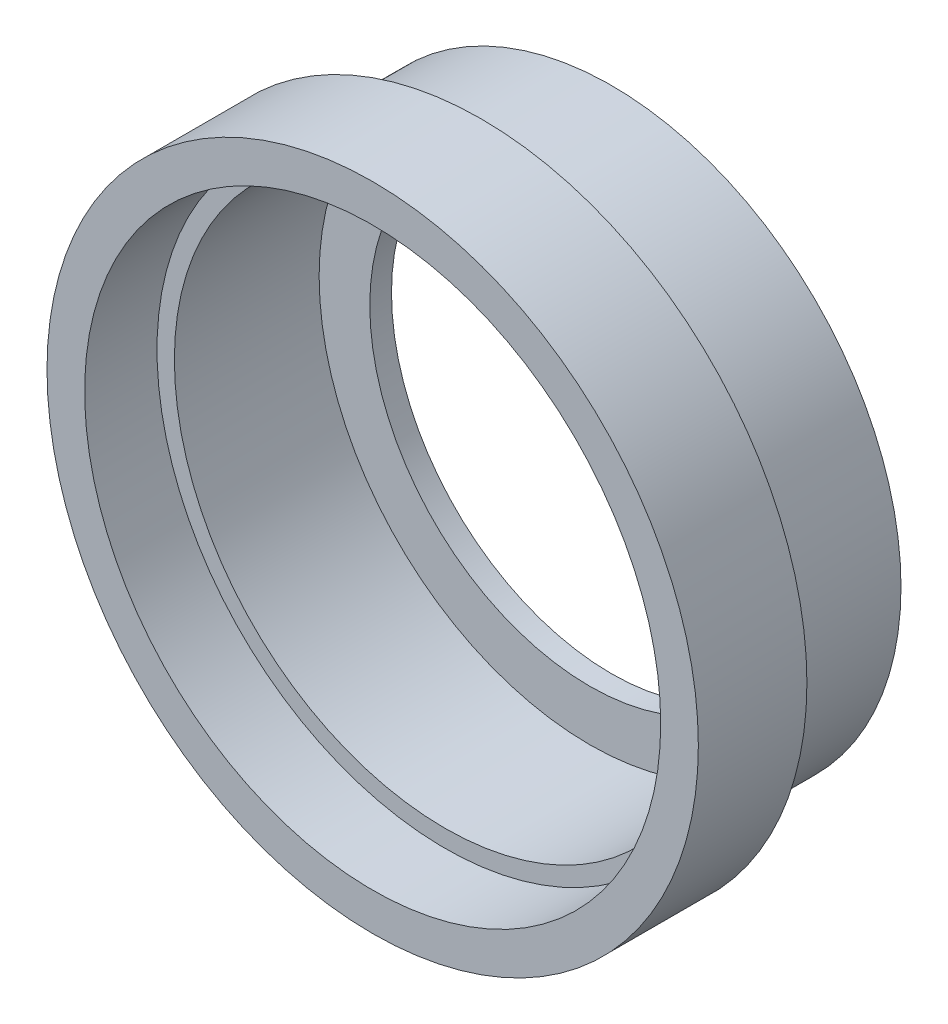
ISO-10303-21;
HEADER;
FILE_DESCRIPTION(('STEP AP214'),'2;1');
FILE_NAME('part.step','',(''),(''),'','','');
FILE_SCHEMA(('AUTOMOTIVE_DESIGN { 1 0 10303 214 1 1 1 1 }'));
ENDSEC;
DATA;
#1=APPLICATION_CONTEXT('core data for automotive mechanical design processes');
#2=APPLICATION_PROTOCOL_DEFINITION('international standard','automotive_design',2000,#1);
#3=PRODUCT_CONTEXT('',#1,'mechanical');
#4=PRODUCT('Part','Part','',(#3));
#5=PRODUCT_RELATED_PRODUCT_CATEGORY('part','',(#4));
#6=PRODUCT_DEFINITION_FORMATION('','',#4);
#7=PRODUCT_DEFINITION_CONTEXT('part definition',#1,'design');
#8=PRODUCT_DEFINITION('design','',#6,#7);
#9=PRODUCT_DEFINITION_SHAPE('','',#8);
#10=(LENGTH_UNIT() NAMED_UNIT(*) SI_UNIT(.MILLI.,.METRE.));
#11=(NAMED_UNIT(*) PLANE_ANGLE_UNIT() SI_UNIT($,.RADIAN.));
#12=(NAMED_UNIT(*) SI_UNIT($,.STERADIAN.) SOLID_ANGLE_UNIT());
#13=UNCERTAINTY_MEASURE_WITH_UNIT(LENGTH_MEASURE(1.E-05),#10,'distance_accuracy_value','');
#14=(GEOMETRIC_REPRESENTATION_CONTEXT(3) GLOBAL_UNCERTAINTY_ASSIGNED_CONTEXT((#13)) GLOBAL_UNIT_ASSIGNED_CONTEXT((#10,
#11,#12)) REPRESENTATION_CONTEXT('',''));
#15=CARTESIAN_POINT('',(0.,0.,0.));
#16=DIRECTION('',(0.,0.,1.));
#17=DIRECTION('',(1.,0.,0.));
#18=AXIS2_PLACEMENT_3D('',#15,#16,#17);
#19=CARTESIAN_POINT('',(0.,0.,20.955));
#20=DIRECTION('',(0.,0.,-1.));
#21=DIRECTION('',(-1.,0.,0.));
#22=AXIS2_PLACEMENT_3D('',#19,#20,#21);
#23=CYLINDRICAL_SURFACE('',#22,19.304);
#24=CARTESIAN_POINT('',(0.,0.,0.));
#25=DIRECTION('',(0.,0.,-1.));
#26=DIRECTION('',(-1.,0.,0.));
#27=AXIS2_PLACEMENT_3D('',#24,#25,#26);
#28=CIRCLE('',#27,19.304);
#29=CARTESIAN_POINT('',(-19.304,0.,0.));
#30=VERTEX_POINT('',#29);
#31=EDGE_CURVE('E48',#30,#30,#28,.T.);
#32=ORIENTED_EDGE('',*,*,#31,.T.);
#33=EDGE_LOOP('',(#32));
#34=FACE_BOUND('',#33,.T.);
#35=CARTESIAN_POINT('',(0.,0.,1.905));
#36=DIRECTION('',(0.,0.,1.));
#37=DIRECTION('',(1.,0.,0.));
#38=AXIS2_PLACEMENT_3D('',#35,#36,#37);
#39=CIRCLE('',#38,19.304);
#40=CARTESIAN_POINT('',(19.304,0.,1.905));
#41=VERTEX_POINT('',#40);
#42=EDGE_CURVE('E32',#41,#41,#39,.F.);
#43=ORIENTED_EDGE('',*,*,#42,.F.);
#44=EDGE_LOOP('',(#43));
#45=FACE_BOUND('',#44,.T.);
#46=ADVANCED_FACE('F28',(#34,#45),#23,.F.);
#47=CARTESIAN_POINT('',(0.,0.,11.43));
#48=DIRECTION('',(0.,0.,-1.));
#49=DIRECTION('',(-1.,0.,0.));
#50=AXIS2_PLACEMENT_3D('',#47,#48,#49);
#51=CYLINDRICAL_SURFACE('',#50,25.4);
#52=CARTESIAN_POINT('',(0.,0.,11.43));
#53=DIRECTION('',(0.,0.,1.));
#54=DIRECTION('',(1.,0.,0.));
#55=AXIS2_PLACEMENT_3D('',#52,#53,#54);
#56=CIRCLE('',#55,25.4);
#57=CARTESIAN_POINT('',(25.4,0.,11.43));
#58=VERTEX_POINT('',#57);
#59=EDGE_CURVE('E10',#58,#58,#56,.T.);
#60=ORIENTED_EDGE('',*,*,#59,.F.);
#61=EDGE_LOOP('',(#60));
#62=FACE_BOUND('',#61,.T.);
#63=CARTESIAN_POINT('',(0.,0.,0.));
#64=DIRECTION('',(0.,0.,1.));
#65=DIRECTION('',(1.,0.,0.));
#66=AXIS2_PLACEMENT_3D('',#63,#64,#65);
#67=CIRCLE('',#66,25.4);
#68=CARTESIAN_POINT('',(25.4,0.,0.));
#69=VERTEX_POINT('',#68);
#70=EDGE_CURVE('E36',#69,#69,#67,.T.);
#71=ORIENTED_EDGE('',*,*,#70,.T.);
#72=EDGE_LOOP('',(#71));
#73=FACE_BOUND('',#72,.T.);
#74=ADVANCED_FACE('F30',(#62,#73),#51,.T.);
#75=CARTESIAN_POINT('',(0.,0.,0.));
#76=DIRECTION('',(0.,0.,1.));
#77=DIRECTION('',(1.,0.,0.));
#78=AXIS2_PLACEMENT_3D('',#75,#76,#77);
#79=PLANE('',#78);
#80=ORIENTED_EDGE('',*,*,#31,.F.);
#81=EDGE_LOOP('',(#80));
#82=FACE_BOUND('',#81,.T.);
#83=ORIENTED_EDGE('',*,*,#70,.F.);
#84=EDGE_LOOP('',(#83));
#85=FACE_BOUND('',#84,.T.);
#86=ADVANCED_FACE('F93',(#82,#85),#79,.F.);
#87=CARTESIAN_POINT('',(0.,0.,11.43));
#88=DIRECTION('',(0.,0.,1.));
#89=DIRECTION('',(1.,0.,0.));
#90=AXIS2_PLACEMENT_3D('',#87,#88,#89);
#91=PLANE('',#90);
#92=CARTESIAN_POINT('',(0.,0.,11.43));
#93=DIRECTION('',(0.,0.,1.));
#94=DIRECTION('',(1.,0.,0.));
#95=AXIS2_PLACEMENT_3D('',#92,#93,#94);
#96=CIRCLE('',#95,28.575);
#97=CARTESIAN_POINT('',(-28.575,0.,11.43));
#98=VERTEX_POINT('',#97);
#99=EDGE_CURVE('E45',#98,#98,#96,.T.);
#100=ORIENTED_EDGE('',*,*,#99,.F.);
#101=EDGE_LOOP('',(#100));
#102=FACE_BOUND('',#101,.T.);
#103=ORIENTED_EDGE('',*,*,#59,.T.);
#104=EDGE_LOOP('',(#103));
#105=FACE_BOUND('',#104,.T.);
#106=ADVANCED_FACE('F88',(#102,#105),#91,.F.);
#107=CARTESIAN_POINT('',(0.,0.,20.955));
#108=DIRECTION('',(0.,0.,-1.));
#109=DIRECTION('',(-1.,0.,0.));
#110=AXIS2_PLACEMENT_3D('',#107,#108,#109);
#111=CYLINDRICAL_SURFACE('',#110,28.575);
#112=CARTESIAN_POINT('',(0.,0.,20.955));
#113=DIRECTION('',(0.,0.,1.));
#114=DIRECTION('',(1.,0.,0.));
#115=AXIS2_PLACEMENT_3D('',#112,#113,#114);
#116=CIRCLE('',#115,28.575);
#117=CARTESIAN_POINT('',(-28.575,0.,20.955));
#118=VERTEX_POINT('',#117);
#119=EDGE_CURVE('E40',#118,#118,#116,.T.);
#120=CARTESIAN_POINT('',(-28.575,0.,20.955));
#121=CARTESIAN_POINT('',(-28.575,0.,20.85578125));
#122=CARTESIAN_POINT('',(-28.575,0.,20.7565625));
#123=CARTESIAN_POINT('',(-28.575,0.,20.558125));
#124=CARTESIAN_POINT('',(-28.575,0.,20.45890625));
#125=CARTESIAN_POINT('',(-28.575,0.,20.26046875));
#126=CARTESIAN_POINT('',(-28.575,0.,20.16125));
#127=CARTESIAN_POINT('',(-28.575,0.,19.9628125));
#128=CARTESIAN_POINT('',(-28.575,0.,19.86359375));
#129=CARTESIAN_POINT('',(-28.575,0.,19.66515625));
#130=CARTESIAN_POINT('',(-28.575,0.,19.5659375));
#131=CARTESIAN_POINT('',(-28.575,0.,19.3675));
#132=CARTESIAN_POINT('',(-28.575,0.,19.26828125));
#133=CARTESIAN_POINT('',(-28.575,0.,19.06984375));
#134=CARTESIAN_POINT('',(-28.575,0.,18.970625));
#135=CARTESIAN_POINT('',(-28.575,0.,18.7721875));
#136=CARTESIAN_POINT('',(-28.575,0.,18.67296875));
#137=CARTESIAN_POINT('',(-28.575,0.,18.47453125));
#138=CARTESIAN_POINT('',(-28.575,0.,18.3753125));
#139=CARTESIAN_POINT('',(-28.575,0.,18.176875));
#140=CARTESIAN_POINT('',(-28.575,0.,18.07765625));
#141=CARTESIAN_POINT('',(-28.575,0.,17.87921875));
#142=CARTESIAN_POINT('',(-28.575,0.,17.78));
#143=CARTESIAN_POINT('',(-28.575,0.,17.5815625));
#144=CARTESIAN_POINT('',(-28.575,0.,17.48234375));
#145=CARTESIAN_POINT('',(-28.575,0.,17.28390625));
#146=CARTESIAN_POINT('',(-28.575,0.,17.1846875));
#147=CARTESIAN_POINT('',(-28.575,0.,16.98625));
#148=CARTESIAN_POINT('',(-28.575,0.,16.88703125));
#149=CARTESIAN_POINT('',(-28.575,0.,16.68859375));
#150=CARTESIAN_POINT('',(-28.575,0.,16.589375));
#151=CARTESIAN_POINT('',(-28.575,0.,16.3909375));
#152=CARTESIAN_POINT('',(-28.575,0.,16.29171875));
#153=CARTESIAN_POINT('',(-28.575,0.,16.09328125));
#154=CARTESIAN_POINT('',(-28.575,0.,15.9940625));
#155=CARTESIAN_POINT('',(-28.575,0.,15.795625));
#156=CARTESIAN_POINT('',(-28.575,0.,15.69640625));
#157=CARTESIAN_POINT('',(-28.575,0.,15.49796875));
#158=CARTESIAN_POINT('',(-28.575,0.,15.39875));
#159=CARTESIAN_POINT('',(-28.575,0.,15.2003125));
#160=CARTESIAN_POINT('',(-28.575,0.,15.10109375));
#161=CARTESIAN_POINT('',(-28.575,0.,14.90265625));
#162=CARTESIAN_POINT('',(-28.575,0.,14.8034375));
#163=CARTESIAN_POINT('',(-28.575,0.,14.605));
#164=CARTESIAN_POINT('',(-28.575,0.,14.50578125));
#165=CARTESIAN_POINT('',(-28.575,0.,14.30734375));
#166=CARTESIAN_POINT('',(-28.575,0.,14.208125));
#167=CARTESIAN_POINT('',(-28.575,0.,14.0096875));
#168=CARTESIAN_POINT('',(-28.575,0.,13.91046875));
#169=CARTESIAN_POINT('',(-28.575,0.,13.71203125));
#170=CARTESIAN_POINT('',(-28.575,0.,13.6128125));
#171=CARTESIAN_POINT('',(-28.575,0.,13.414375));
#172=CARTESIAN_POINT('',(-28.575,0.,13.31515625));
#173=CARTESIAN_POINT('',(-28.575,0.,13.11671875));
#174=CARTESIAN_POINT('',(-28.575,0.,13.0175));
#175=CARTESIAN_POINT('',(-28.575,0.,12.8190625));
#176=CARTESIAN_POINT('',(-28.575,0.,12.71984375));
#177=CARTESIAN_POINT('',(-28.575,0.,12.52140625));
#178=CARTESIAN_POINT('',(-28.575,0.,12.4221875));
#179=CARTESIAN_POINT('',(-28.575,0.,12.22375));
#180=CARTESIAN_POINT('',(-28.575,0.,12.12453125));
#181=CARTESIAN_POINT('',(-28.575,0.,11.92609375));
#182=CARTESIAN_POINT('',(-28.575,0.,11.826875));
#183=CARTESIAN_POINT('',(-28.575,0.,11.6284375));
#184=CARTESIAN_POINT('',(-28.575,0.,11.52921875));
#185=CARTESIAN_POINT('',(-28.575,0.,11.43));
#186=B_SPLINE_CURVE_WITH_KNOTS('',3,(#120,#121,#122,#123,#124,#125,#126,#127,#128,#129,#130,
#131,#132,#133,#134,#135,#136,#137,#138,#139,#140,#141,#142,#143,#144,#145,#146,#147,#148,#149,
#150,#151,#152,#153,#154,#155,#156,#157,#158,#159,#160,#161,#162,#163,#164,#165,#166,#167,#168,
#169,#170,#171,#172,#173,#174,#175,#176,#177,#178,#179,#180,#181,#182,#183,#184,#185),
.UNSPECIFIED.,.F.,.F.,(4,2,2,2,2,2,2,2,2,2,2,2,2,2,2,2,2,2,2,2,2,2,2,2,2,2,2,2,2,2,2,2,4),(0.,
0.29765625,0.5953125,0.892968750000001,1.190625,1.48828125,1.7859375,2.08359375,2.38125,
2.67890625,2.9765625,3.27421875,3.571875,3.86953125,4.1671875,4.46484375,4.7625,5.06015625,
5.3578125,5.65546875,5.953125,6.25078125,6.5484375,6.84609375,7.14375,7.44140625,7.7390625,
8.03671875,8.334375,8.63203125,8.9296875,9.22734375,9.525),.UNSPECIFIED.);
#187=EDGE_CURVE('BSEAM82',#118,#98,#186,.T.);
#188=ORIENTED_EDGE('',*,*,#119,.F.);
#189=ORIENTED_EDGE('',*,*,#99,.T.);
#190=ORIENTED_EDGE('',*,*,#187,.T.);
#191=ORIENTED_EDGE('',*,*,#187,.F.);
#192=EDGE_LOOP('',(#188,#190,#189,#191));
#193=FACE_BOUND('',#192,.T.);
#194=ADVANCED_FACE('F82',(#193),#111,.T.);
#195=CARTESIAN_POINT('',(0.,0.,20.955));
#196=DIRECTION('',(0.,0.,1.));
#197=DIRECTION('',(1.,0.,0.));
#198=AXIS2_PLACEMENT_3D('',#195,#196,#197);
#199=PLANE('',#198);
#200=CARTESIAN_POINT('',(0.,0.,20.955));
#201=DIRECTION('',(0.,0.,1.));
#202=DIRECTION('',(1.,0.,0.));
#203=AXIS2_PLACEMENT_3D('',#200,#201,#202);
#204=CIRCLE('',#203,25.273);
#205=CARTESIAN_POINT('',(25.273,0.,20.955));
#206=VERTEX_POINT('',#205);
#207=EDGE_CURVE('E54',#206,#206,#204,.T.);
#208=ORIENTED_EDGE('',*,*,#207,.F.);
#209=EDGE_LOOP('',(#208));
#210=FACE_BOUND('',#209,.T.);
#211=ORIENTED_EDGE('',*,*,#119,.T.);
#212=EDGE_LOOP('',(#211));
#213=FACE_BOUND('',#212,.T.);
#214=ADVANCED_FACE('F70',(#210,#213),#199,.T.);
#215=CARTESIAN_POINT('',(0.,0.,14.605));
#216=DIRECTION('',(0.,0.,1.));
#217=DIRECTION('',(1.,0.,0.));
#218=AXIS2_PLACEMENT_3D('',#215,#216,#217);
#219=PLANE('',#218);
#220=CARTESIAN_POINT('',(0.,0.,14.605));
#221=DIRECTION('',(0.,0.,1.));
#222=DIRECTION('',(1.,0.,0.));
#223=AXIS2_PLACEMENT_3D('',#220,#221,#222);
#224=CIRCLE('',#223,23.749);
#225=CARTESIAN_POINT('',(23.749,0.,14.605));
#226=VERTEX_POINT('',#225);
#227=EDGE_CURVE('E60',#226,#226,#224,.T.);
#228=ORIENTED_EDGE('',*,*,#227,.F.);
#229=EDGE_LOOP('',(#228));
#230=FACE_BOUND('',#229,.T.);
#231=CARTESIAN_POINT('',(0.,0.,14.605));
#232=DIRECTION('',(0.,0.,1.));
#233=DIRECTION('',(1.,0.,0.));
#234=AXIS2_PLACEMENT_3D('',#231,#232,#233);
#235=CIRCLE('',#234,25.273);
#236=CARTESIAN_POINT('',(25.273,0.,14.605));
#237=VERTEX_POINT('',#236);
#238=EDGE_CURVE('E51',#237,#237,#235,.T.);
#239=ORIENTED_EDGE('',*,*,#238,.T.);
#240=EDGE_LOOP('',(#239));
#241=FACE_BOUND('',#240,.T.);
#242=ADVANCED_FACE('F66',(#230,#241),#219,.T.);
#243=CARTESIAN_POINT('',(0.,0.,14.605));
#244=DIRECTION('',(0.,0.,1.));
#245=DIRECTION('',(1.,0.,0.));
#246=AXIS2_PLACEMENT_3D('',#243,#244,#245);
#247=CYLINDRICAL_SURFACE('',#246,25.273);
#248=ORIENTED_EDGE('',*,*,#238,.F.);
#249=EDGE_LOOP('',(#248));
#250=FACE_BOUND('',#249,.T.);
#251=ORIENTED_EDGE('',*,*,#207,.T.);
#252=EDGE_LOOP('',(#251));
#253=FACE_BOUND('',#252,.T.);
#254=ADVANCED_FACE('F69',(#250,#253),#247,.F.);
#255=CARTESIAN_POINT('',(0.,0.,1.905));
#256=DIRECTION('',(0.,0.,1.));
#257=DIRECTION('',(1.,0.,0.));
#258=AXIS2_PLACEMENT_3D('',#255,#256,#257);
#259=PLANE('',#258);
#260=CARTESIAN_POINT('',(0.,0.,1.905));
#261=DIRECTION('',(0.,0.,1.));
#262=DIRECTION('',(1.,0.,0.));
#263=AXIS2_PLACEMENT_3D('',#260,#261,#262);
#264=CIRCLE('',#263,23.749);
#265=CARTESIAN_POINT('',(23.749,0.,1.905));
#266=VERTEX_POINT('',#265);
#267=EDGE_CURVE('E57',#266,#266,#264,.T.);
#268=ORIENTED_EDGE('',*,*,#267,.T.);
#269=EDGE_LOOP('',(#268));
#270=FACE_BOUND('',#269,.T.);
#271=ORIENTED_EDGE('',*,*,#42,.T.);
#272=EDGE_LOOP('',(#271));
#273=FACE_BOUND('',#272,.T.);
#274=ADVANCED_FACE('F76',(#270,#273),#259,.T.);
#275=CARTESIAN_POINT('',(0.,0.,1.905));
#276=DIRECTION('',(0.,0.,1.));
#277=DIRECTION('',(1.,0.,0.));
#278=AXIS2_PLACEMENT_3D('',#275,#276,#277);
#279=CYLINDRICAL_SURFACE('',#278,23.749);
#280=ORIENTED_EDGE('',*,*,#267,.F.);
#281=EDGE_LOOP('',(#280));
#282=FACE_BOUND('',#281,.T.);
#283=ORIENTED_EDGE('',*,*,#227,.T.);
#284=EDGE_LOOP('',(#283));
#285=FACE_BOUND('',#284,.T.);
#286=ADVANCED_FACE('F64',(#282,#285),#279,.F.);
#287=CLOSED_SHELL('',(#46,#74,#86,#106,#194,#214,#242,#254,#274,#286));
#288=MANIFOLD_SOLID_BREP('B2',#287);
#289=ADVANCED_BREP_SHAPE_REPRESENTATION('',(#18,#288),#14);
#290=SHAPE_DEFINITION_REPRESENTATION(#9,#289);
ENDSEC;
END-ISO-10303-21;
